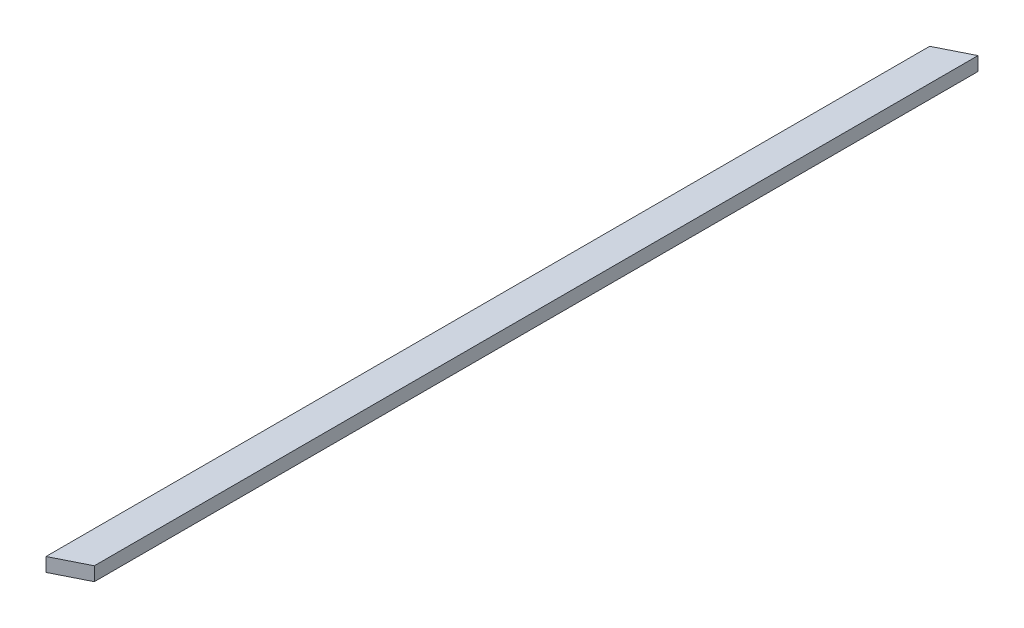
ISO-10303-21;
HEADER;
FILE_DESCRIPTION(('STEP AP214'),'2;1');
FILE_NAME('part.step','',(''),(''),'','','');
FILE_SCHEMA(('AUTOMOTIVE_DESIGN { 1 0 10303 214 1 1 1 1 }'));
ENDSEC;
DATA;
#1=APPLICATION_CONTEXT('core data for automotive mechanical design processes');
#2=APPLICATION_PROTOCOL_DEFINITION('international standard','automotive_design',2000,#1);
#3=PRODUCT_CONTEXT('',#1,'mechanical');
#4=PRODUCT('Part','Part','',(#3));
#5=PRODUCT_RELATED_PRODUCT_CATEGORY('part','',(#4));
#6=PRODUCT_DEFINITION_FORMATION('','',#4);
#7=PRODUCT_DEFINITION_CONTEXT('part definition',#1,'design');
#8=PRODUCT_DEFINITION('design','',#6,#7);
#9=PRODUCT_DEFINITION_SHAPE('','',#8);
#10=(LENGTH_UNIT() NAMED_UNIT(*) SI_UNIT(.MILLI.,.METRE.));
#11=(NAMED_UNIT(*) PLANE_ANGLE_UNIT() SI_UNIT($,.RADIAN.));
#12=(NAMED_UNIT(*) SI_UNIT($,.STERADIAN.) SOLID_ANGLE_UNIT());
#13=UNCERTAINTY_MEASURE_WITH_UNIT(LENGTH_MEASURE(1.E-05),#10,'distance_accuracy_value','');
#14=(GEOMETRIC_REPRESENTATION_CONTEXT(3) GLOBAL_UNCERTAINTY_ASSIGNED_CONTEXT((#13)) GLOBAL_UNIT_ASSIGNED_CONTEXT((#10,
#11,#12)) REPRESENTATION_CONTEXT('',''));
#15=CARTESIAN_POINT('',(0.,0.,0.));
#16=DIRECTION('',(0.,0.,1.));
#17=DIRECTION('',(1.,0.,0.));
#18=AXIS2_PLACEMENT_3D('',#15,#16,#17);
#19=CARTESIAN_POINT('',(-88.9000000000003,38.1,44.4595986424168));
#20=DIRECTION('',(0.447290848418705,0.,0.894388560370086));
#21=DIRECTION('',(0.894388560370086,0.,-0.447290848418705));
#22=AXIS2_PLACEMENT_3D('',#19,#20,#21);
#23=PLANE('',#22);
#24=DIRECTION('',(-0.894388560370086,0.,0.447290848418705));
#25=VECTOR('',#24,1.);
#26=CARTESIAN_POINT('',(-88.9000000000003,0.,44.4595986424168));
#27=LINE('',#26,#25);
#28=CARTESIAN_POINT('',(0.,0.,0.));
#29=VERTEX_POINT('',#28);
#30=CARTESIAN_POINT('',(-88.9000000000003,0.,44.4595986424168));
#31=VERTEX_POINT('',#30);
#32=EDGE_CURVE('E96',#29,#31,#27,.T.);
#33=ORIENTED_EDGE('',*,*,#32,.T.);
#34=DIRECTION('',(0.,-1.,0.));
#35=VECTOR('',#34,1.);
#36=CARTESIAN_POINT('',(-88.9000000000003,38.1,44.4595986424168));
#37=LINE('',#36,#35);
#38=CARTESIAN_POINT('',(-88.9000000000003,38.1,44.4595986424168));
#39=VERTEX_POINT('',#38);
#40=EDGE_CURVE('E11',#39,#31,#37,.T.);
#41=ORIENTED_EDGE('',*,*,#40,.F.);
#42=DIRECTION('',(-0.894388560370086,0.,0.447290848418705));
#43=VECTOR('',#42,1.);
#44=CARTESIAN_POINT('',(-88.9000000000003,38.1,44.4595986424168));
#45=LINE('',#44,#43);
#46=CARTESIAN_POINT('',(0.,38.1,0.));
#47=VERTEX_POINT('',#46);
#48=EDGE_CURVE('E84',#47,#39,#45,.T.);
#49=ORIENTED_EDGE('',*,*,#48,.F.);
#50=DIRECTION('',(0.,-1.,0.));
#51=VECTOR('',#50,1.);
#52=CARTESIAN_POINT('',(0.,38.1,0.));
#53=LINE('',#52,#51);
#54=EDGE_CURVE('E92',#47,#29,#53,.T.);
#55=ORIENTED_EDGE('',*,*,#54,.T.);
#56=EDGE_LOOP('',(#33,#41,#49,#55));
#57=FACE_BOUND('',#56,.T.);
#58=ADVANCED_FACE('F33',(#57),#23,.F.);
#59=CARTESIAN_POINT('',(-88.8999999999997,38.1,2482.85959864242));
#60=DIRECTION('',(1.,0.,0.));
#61=DIRECTION('',(0.,0.,-1.));
#62=AXIS2_PLACEMENT_3D('',#59,#60,#61);
#63=PLANE('',#62);
#64=DIRECTION('',(0.,0.,1.));
#65=VECTOR('',#64,1.);
#66=CARTESIAN_POINT('',(-88.8999999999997,0.,2482.85959864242));
#67=LINE('',#66,#65);
#68=CARTESIAN_POINT('',(-88.8999999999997,0.,2482.85959864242));
#69=VERTEX_POINT('',#68);
#70=EDGE_CURVE('E88',#31,#69,#67,.T.);
#71=ORIENTED_EDGE('',*,*,#70,.T.);
#72=DIRECTION('',(0.,-1.,0.));
#73=VECTOR('',#72,1.);
#74=CARTESIAN_POINT('',(-88.8999999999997,38.1,2482.85959864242));
#75=LINE('',#74,#73);
#76=CARTESIAN_POINT('',(-88.8999999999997,38.1,2482.85959864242));
#77=VERTEX_POINT('',#76);
#78=EDGE_CURVE('E41',#77,#69,#75,.T.);
#79=ORIENTED_EDGE('',*,*,#78,.F.);
#80=DIRECTION('',(0.,0.,1.));
#81=VECTOR('',#80,1.);
#82=CARTESIAN_POINT('',(-88.8999999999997,38.1,2482.85959864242));
#83=LINE('',#82,#81);
#84=EDGE_CURVE('E79',#39,#77,#83,.T.);
#85=ORIENTED_EDGE('',*,*,#84,.F.);
#86=ORIENTED_EDGE('',*,*,#40,.T.);
#87=EDGE_LOOP('',(#71,#79,#85,#86));
#88=FACE_BOUND('',#87,.T.);
#89=ADVANCED_FACE('F87',(#88),#63,.F.);
#90=CARTESIAN_POINT('',(2.9861787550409E-13,38.1,2438.4));
#91=DIRECTION('',(-0.447290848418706,0.,-0.894388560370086));
#92=DIRECTION('',(-0.894388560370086,0.,0.447290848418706));
#93=AXIS2_PLACEMENT_3D('',#90,#91,#92);
#94=PLANE('',#93);
#95=DIRECTION('',(0.894388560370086,0.,-0.447290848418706));
#96=VECTOR('',#95,1.);
#97=CARTESIAN_POINT('',(2.9861787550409E-13,0.,2438.4));
#98=LINE('',#97,#96);
#99=CARTESIAN_POINT('',(2.9861787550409E-13,0.,2438.4));
#100=VERTEX_POINT('',#99);
#101=EDGE_CURVE('E66',#69,#100,#98,.T.);
#102=ORIENTED_EDGE('',*,*,#101,.T.);
#103=DIRECTION('',(0.,-1.,0.));
#104=VECTOR('',#103,1.);
#105=CARTESIAN_POINT('',(2.9861787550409E-13,38.1,2438.4));
#106=LINE('',#105,#104);
#107=CARTESIAN_POINT('',(2.9861787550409E-13,38.1,2438.4));
#108=VERTEX_POINT('',#107);
#109=EDGE_CURVE('E89',#108,#100,#106,.T.);
#110=ORIENTED_EDGE('',*,*,#109,.F.);
#111=DIRECTION('',(0.894388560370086,0.,-0.447290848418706));
#112=VECTOR('',#111,1.);
#113=CARTESIAN_POINT('',(2.9861787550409E-13,38.1,2438.4));
#114=LINE('',#113,#112);
#115=EDGE_CURVE('E82',#77,#108,#114,.T.);
#116=ORIENTED_EDGE('',*,*,#115,.F.);
#117=ORIENTED_EDGE('',*,*,#78,.T.);
#118=EDGE_LOOP('',(#102,#110,#116,#117));
#119=FACE_BOUND('',#118,.T.);
#120=ADVANCED_FACE('F90',(#119),#94,.F.);
#121=CARTESIAN_POINT('',(0.,38.1,0.));
#122=DIRECTION('',(-1.,0.,0.));
#123=DIRECTION('',(0.,0.,1.));
#124=AXIS2_PLACEMENT_3D('',#121,#122,#123);
#125=PLANE('',#124);
#126=DIRECTION('',(0.,0.,-1.));
#127=VECTOR('',#126,1.);
#128=CARTESIAN_POINT('',(0.,0.,0.));
#129=LINE('',#128,#127);
#130=EDGE_CURVE('E72',#100,#29,#129,.T.);
#131=ORIENTED_EDGE('',*,*,#130,.T.);
#132=ORIENTED_EDGE('',*,*,#54,.F.);
#133=DIRECTION('',(0.,0.,-1.));
#134=VECTOR('',#133,1.);
#135=CARTESIAN_POINT('',(0.,38.1,0.));
#136=LINE('',#135,#134);
#137=EDGE_CURVE('E49',#108,#47,#136,.T.);
#138=ORIENTED_EDGE('',*,*,#137,.F.);
#139=ORIENTED_EDGE('',*,*,#109,.T.);
#140=EDGE_LOOP('',(#131,#132,#138,#139));
#141=FACE_BOUND('',#140,.T.);
#142=ADVANCED_FACE('F103',(#141),#125,.F.);
#143=CARTESIAN_POINT('',(0.,38.1,0.));
#144=DIRECTION('',(0.,-1.,0.));
#145=DIRECTION('',(0.,0.,-1.));
#146=AXIS2_PLACEMENT_3D('',#143,#144,#145);
#147=PLANE('',#146);
#148=ORIENTED_EDGE('',*,*,#48,.T.);
#149=ORIENTED_EDGE('',*,*,#84,.T.);
#150=ORIENTED_EDGE('',*,*,#115,.T.);
#151=ORIENTED_EDGE('',*,*,#137,.T.);
#152=EDGE_LOOP('',(#148,#149,#150,#151));
#153=FACE_BOUND('',#152,.T.);
#154=ADVANCED_FACE('F80',(#153),#147,.F.);
#155=CARTESIAN_POINT('',(0.,0.,0.));
#156=DIRECTION('',(0.,-1.,0.));
#157=DIRECTION('',(0.,0.,-1.));
#158=AXIS2_PLACEMENT_3D('',#155,#156,#157);
#159=PLANE('',#158);
#160=ORIENTED_EDGE('',*,*,#32,.F.);
#161=ORIENTED_EDGE('',*,*,#130,.F.);
#162=ORIENTED_EDGE('',*,*,#101,.F.);
#163=ORIENTED_EDGE('',*,*,#70,.F.);
#164=EDGE_LOOP('',(#160,#161,#162,#163));
#165=FACE_BOUND('',#164,.T.);
#166=ADVANCED_FACE('F106',(#165),#159,.T.);
#167=CLOSED_SHELL('',(#58,#89,#120,#142,#154,#166));
#168=MANIFOLD_SOLID_BREP('B2',#167);
#169=ADVANCED_BREP_SHAPE_REPRESENTATION('',(#18,#168),#14);
#170=SHAPE_DEFINITION_REPRESENTATION(#9,#169);
ENDSEC;
END-ISO-10303-21;
